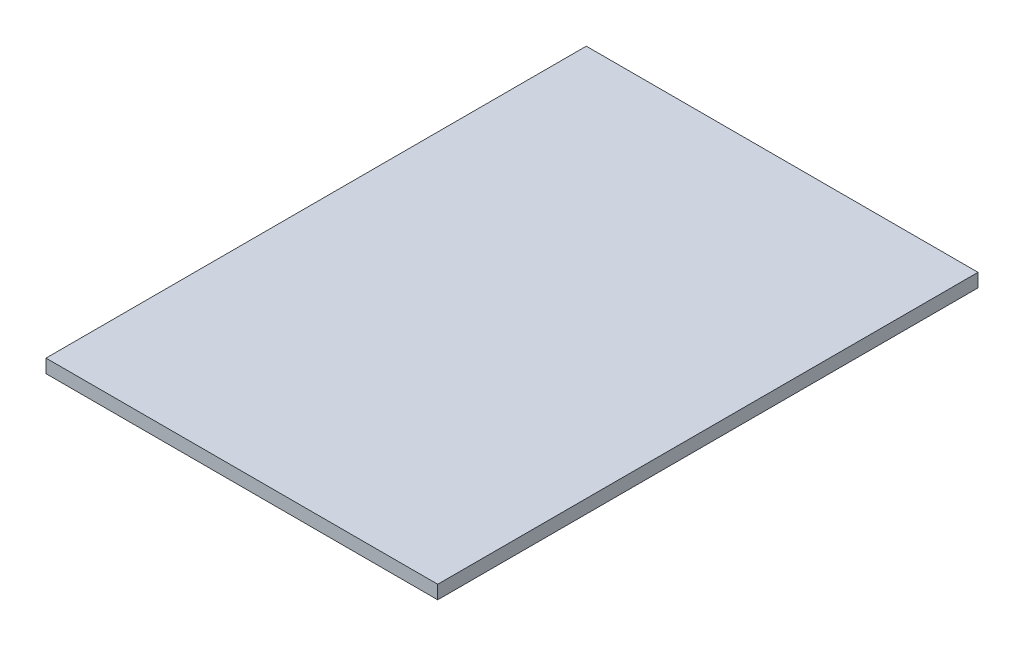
from build123d import *

# Parameters (mm, degrees)
SKETCH1_W           = 290
SKETCH1_H           = 400
BOSS_EXTRUDE1_DEPTH = 10


with BuildPart() as part:
    # Sketch1 → Boss-Extrude1 (new body)
    with BuildSketch(Plane(origin=(0, 0, 0), x_dir=(1, 0, 0), z_dir=(0, 1, 0))):
        with Locations((145, 200)):
            Rectangle(SKETCH1_W, SKETCH1_H)
    extrude(amount=BOSS_EXTRUDE1_DEPTH)


solid = part.part
